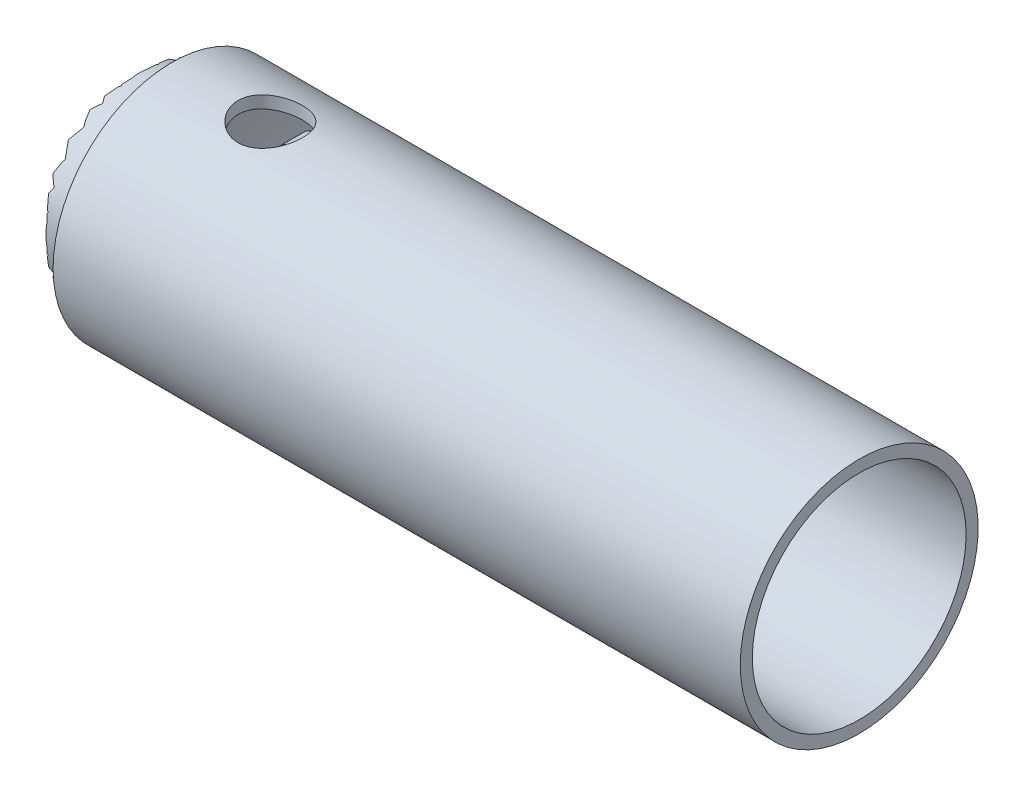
from build123d import *

# Parameters (mm, degrees)
SKETCH4_R            = 1.7145
CUT_EXTRUDE1_DEPTH   = 2.54
CUT_EXTRUDE2_DEPTH   = 38.848820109
LPATTERN1_COUNT      = 6
LPATTERN1_PITCH      = 0.9906
CUT_EXTRUDE3_DEPTH   = 38.848820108
LPATTERN2_COUNT      = 6
LPATTERN2_PITCH      = 0.9906
MIRROR1_COPY_1_DEPTH = 38.848820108
MIRROR1_COPY_2_DEPTH = 38.848820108
MIRROR1_COPY_3_DEPTH = 38.848820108
MIRROR1_COPY_4_DEPTH = 38.848820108
MIRROR1_COPY_5_DEPTH = 38.848820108
MIRROR1_COPY_6_DEPTH = 38.848820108
LPATTERN3_COUNT      = 6
LPATTERN3_PITCH      = 0.9906
SKETCH8_R            = 1.7145
BOSS_EXTRUDE2_DEPTH  = 0.64135
BOSS_EXTRUDE3_DEPTH  = 0.635


with BuildPart() as part:
    # Sketch1 → Revolve2 (revolve)
    with BuildSketch(Plane.XY, mode=Mode.PRIVATE) as revolve2_sk:
        Polygon((0, 0), (1.524523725, 5.6896), (35.560523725, 5.6896), (35.560523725, 6.33095), (-1.015476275, 6.33095), (-1.015476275, 4.9784), (-3.047476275, 4.9784), (-3.047476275, 0), align=None)
    revolve(revolve2_sk.sketch.rotate(Axis((0, 0, 0), (1, 0, 0)), 90), axis=Axis((0, 0, 0), (1, 0, 0)))

    # Sketch4 → Cut-Extrude1 (cut)
    with BuildSketch(Plane(origin=(0, 6.33095, 0), x_dir=(-1, 0, 0), z_dir=(0, 1, 0))):
        with Locations(Location((-4.216989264, 0, 0), (0, 0, 90))):
            Circle(SKETCH4_R)
    extrude(amount=-CUT_EXTRUDE1_DEPTH, mode=Mode.SUBTRACT)

    # Sketch10 → Cut-Extrude2 (cut, through all)
    with BuildSketch(Plane.XZ.offset(4.9784)):
        Polygon((-3.047476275, -0.4953), (-2.731467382, 0), (-3.047476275, 0.4953), (-3.230304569, 0), align=None)
    cut_extrude2 = extrude(amount=-CUT_EXTRUDE2_DEPTH, mode=Mode.SUBTRACT)

    # LPattern1: Cut-Extrude2 ×6
    with Locations(*[(0, 0, -i * LPATTERN1_PITCH) for i in range(1, LPATTERN1_COUNT)]):
        add(cut_extrude2, mode=Mode.SUBTRACT)

    # Sketch12 → Cut-Extrude3 (cut, through all)
    with BuildSketch(Plane(origin=(0, 0, -4.9784), x_dir=(-1, 0, 0), z_dir=(0, 0, -1))):
        Polygon((3.047476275, -0.4953), (2.731467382, 0), (3.047476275, 0.4953), (3.19523591, 0), align=None)
    cut_extrude3 = extrude(amount=-CUT_EXTRUDE3_DEPTH, mode=Mode.SUBTRACT)

    # LPattern2: Cut-Extrude3 ×6
    with Locations(*[(0, -i * LPATTERN2_PITCH, 0) for i in range(1, LPATTERN2_COUNT)]):
        add(cut_extrude3, mode=Mode.SUBTRACT)

    # Mirror1 copy 1 sketch → Mirror1 copy 1 (cut, through all)
    with BuildSketch(Plane(origin=(0, 0.9906, -4.9784), x_dir=(-1, 0, 0), z_dir=(0, 0, -1))):
        Polygon((3.047476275, 0.4953), (2.731467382, 0), (3.047476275, -0.4953), (3.19523591, 0), align=None)
    extrude(amount=-MIRROR1_COPY_1_DEPTH, mode=Mode.SUBTRACT)

    # Mirror1 copy 2 sketch → Mirror1 copy 2 (cut, through all)
    with BuildSketch(Plane(origin=(0, 1.9812, -4.9784), x_dir=(-1, 0, 0), z_dir=(0, 0, -1))):
        Polygon((3.047476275, 0.4953), (2.731467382, 0), (3.047476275, -0.4953), (3.19523591, 0), align=None)
    extrude(amount=-MIRROR1_COPY_2_DEPTH, mode=Mode.SUBTRACT)

    # Mirror1 copy 3 sketch → Mirror1 copy 3 (cut, through all)
    with BuildSketch(Plane(origin=(0, 2.9718, -4.9784), x_dir=(-1, 0, 0), z_dir=(0, 0, -1))):
        Polygon((3.047476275, 0.4953), (2.731467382, 0), (3.047476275, -0.4953), (3.19523591, 0), align=None)
    extrude(amount=-MIRROR1_COPY_3_DEPTH, mode=Mode.SUBTRACT)

    # Mirror1 copy 4 sketch → Mirror1 copy 4 (cut, through all)
    with BuildSketch(Plane(origin=(0, 3.9624, -4.9784), x_dir=(-1, 0, 0), z_dir=(0, 0, -1))):
        Polygon((3.047476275, 0.4953), (2.731467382, 0), (3.047476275, -0.4953), (3.19523591, 0), align=None)
    extrude(amount=-MIRROR1_COPY_4_DEPTH, mode=Mode.SUBTRACT)

    # Mirror1 copy 5 sketch → Mirror1 copy 5 (cut, through all)
    with BuildSketch(Plane(origin=(0, 4.953, -4.9784), x_dir=(-1, 0, 0), z_dir=(0, 0, -1))):
        Polygon((3.047476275, 0.4953), (2.731467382, 0), (3.047476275, -0.4953), (3.19523591, 0), align=None)
    extrude(amount=-MIRROR1_COPY_5_DEPTH, mode=Mode.SUBTRACT)

    # Mirror1 copy 6 sketch → Mirror1 copy 6 (cut, through all)
    with BuildSketch(Plane(origin=(0, 0, -4.9784), x_dir=(-1, 0, 0), z_dir=(0, 0, -1))):
        Polygon((3.047476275, 0.4953), (2.731467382, 0), (3.047476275, -0.4953), (3.19523591, 0), align=None)
    extrude(amount=-MIRROR1_COPY_6_DEPTH, mode=Mode.SUBTRACT)

    # LPattern3: Cut-Extrude2 ×6
    with Locations(*[(0, 0, i * LPATTERN3_PITCH) for i in range(1, LPATTERN3_COUNT)]):
        add(cut_extrude2, mode=Mode.SUBTRACT)



with BuildPart() as body_2:
    # Sketch8 → Boss-Extrude2 (new body)
    with BuildSketch(Plane(origin=(1.446973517, -0.973411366, 0), x_dir=(0, 0, -1), z_dir=(0.8297240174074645, -0.558173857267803, 0))):
        with Locations(Location((0, 5.94893373, 0), (0, 0, 90))):
            Circle(SKETCH8_R)
    extrude(amount=-BOSS_EXTRUDE2_DEPTH)


with BuildPart() as part_1:
    add(part.part)

    add(body_2.part)  # Boss-Extrude3 merges body 2
    # Sketch9 → Boss-Extrude3 (add, symmetric)
    with BuildSketch(Plane.XY):
        with BuildLine():
            Line((5.866205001, 5.595764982), (10.583383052, 5.595764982))
            Line((10.583383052, 5.595764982), (10.583383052, 6.237114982))
            Line((10.583383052, 6.237114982), (5.93045085, 6.237114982))
            ThreePointArc((5.93045085, 6.237114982), (5.572300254, 6.147701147), (5.298201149, 5.900443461))
            Line((5.298201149, 5.900443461), (5.108554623, 5.618534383))
            Line((5.108554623, 5.618534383), (5.640698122, 5.260549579))
            Line((5.640698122, 5.260549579), (5.866205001, 5.595764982))
        make_face()
    extrude(amount=BOSS_EXTRUDE3_DEPTH, both=True)


solid = part_1.part
